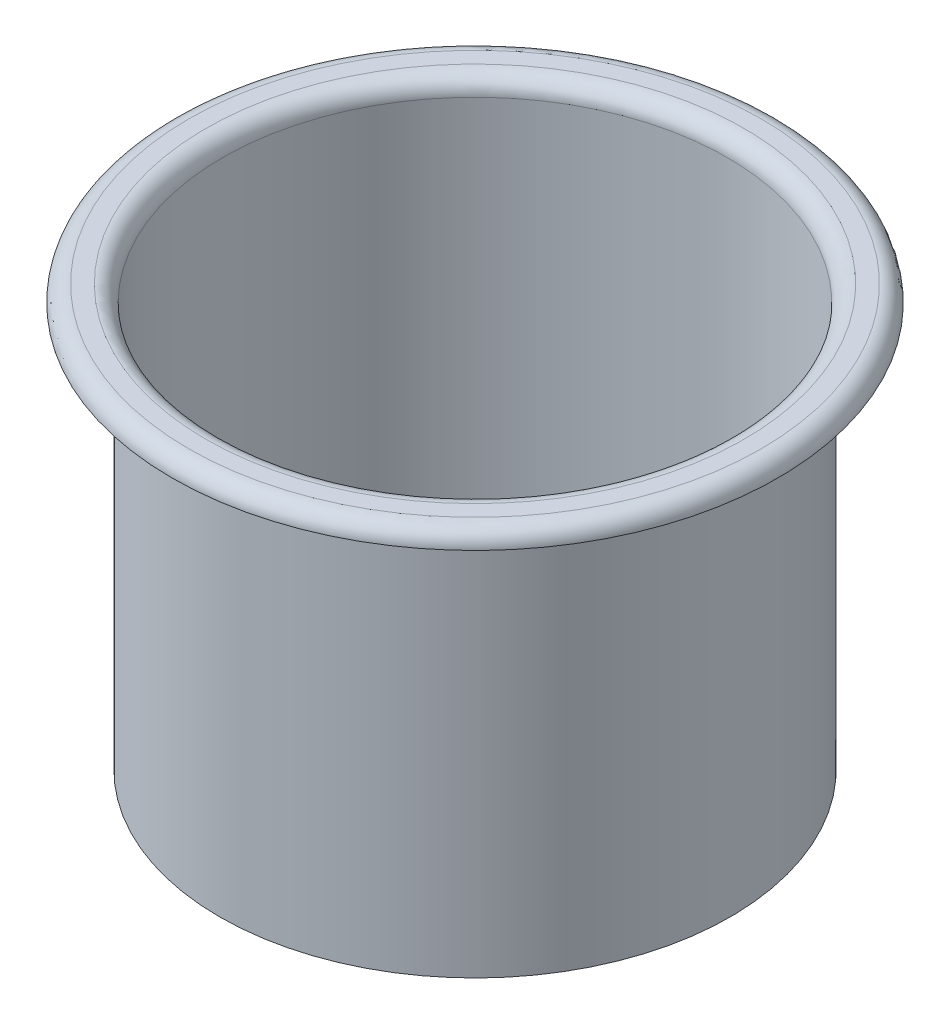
from build123d import *


with BuildPart() as part:
    # Sketch1 → Revolve1 (revolve)
    with BuildSketch(Plane(origin=(0, 0, 0), x_dir=(-1, 0, 0), z_dir=(0, 0, -1)), mode=Mode.PRIVATE) as revolve1_sk:
        with BuildLine():
            Line((-90, 0), (-89.1, 0))
            ThreePointArc((-89.1, 0), (-87.899137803, 2.899137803), (-85, 4.1))
            Line((-85, 4.1), (-80, 4.1))
            ThreePointArc((-80, 4.1), (-77.100862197, 2.899137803), (-75.9, 0))
            Line((-75.9, 0), (-75.9, -120))
            Line((-75.9, -120), (-75, -120))
            Line((-75, -120), (-75, 0))
            ThreePointArc((-75, 0), (-76.464466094, 3.535533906), (-80, 5))
            Line((-80, 5), (-85, 5))
            ThreePointArc((-85, 5), (-88.535533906, 3.535533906), (-90, 0))
        make_face()
    revolve(revolve1_sk.sketch.rotate(Axis((0, -120, 0), (0, 1, 0)), 270), axis=Axis((0, -120, 0), (0, 1, 0)))


solid = part.part
